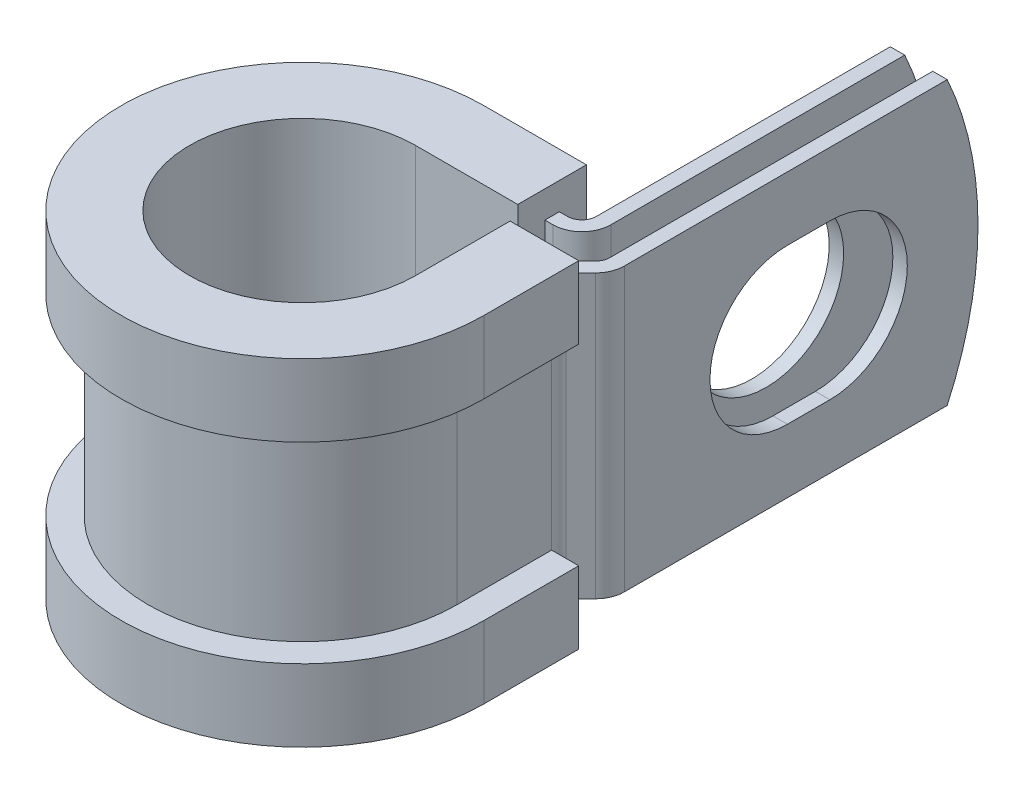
ISO-10303-21;
HEADER;
FILE_DESCRIPTION(('STEP AP214'),'2;1');
FILE_NAME('part.step','',(''),(''),'','','');
FILE_SCHEMA(('AUTOMOTIVE_DESIGN { 1 0 10303 214 1 1 1 1 }'));
ENDSEC;
DATA;
#1=APPLICATION_CONTEXT('core data for automotive mechanical design processes');
#2=APPLICATION_PROTOCOL_DEFINITION('international standard','automotive_design',2000,#1);
#3=PRODUCT_CONTEXT('',#1,'mechanical');
#4=PRODUCT('Part','Part','',(#3));
#5=PRODUCT_RELATED_PRODUCT_CATEGORY('part','',(#4));
#6=PRODUCT_DEFINITION_FORMATION('','',#4);
#7=PRODUCT_DEFINITION_CONTEXT('part definition',#1,'design');
#8=PRODUCT_DEFINITION('design','',#6,#7);
#9=PRODUCT_DEFINITION_SHAPE('','',#8);
#10=(LENGTH_UNIT() NAMED_UNIT(*) SI_UNIT(.MILLI.,.METRE.));
#11=(NAMED_UNIT(*) PLANE_ANGLE_UNIT() SI_UNIT($,.RADIAN.));
#12=(NAMED_UNIT(*) SI_UNIT($,.STERADIAN.) SOLID_ANGLE_UNIT());
#13=UNCERTAINTY_MEASURE_WITH_UNIT(LENGTH_MEASURE(1.E-05),#10,'distance_accuracy_value','');
#14=(GEOMETRIC_REPRESENTATION_CONTEXT(3) GLOBAL_UNCERTAINTY_ASSIGNED_CONTEXT((#13)) GLOBAL_UNIT_ASSIGNED_CONTEXT((#10,
#11,#12)) REPRESENTATION_CONTEXT('',''));
#15=CARTESIAN_POINT('',(0.,0.,0.));
#16=DIRECTION('',(0.,0.,1.));
#17=DIRECTION('',(1.,0.,0.));
#18=AXIS2_PLACEMENT_3D('',#15,#16,#17);
#19=CARTESIAN_POINT('',(8.60157438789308,-7.9375,-7.874));
#20=DIRECTION('',(0.,1.,0.));
#21=DIRECTION('',(1.,0.,0.));
#22=AXIS2_PLACEMENT_3D('',#19,#20,#21);
#23=PLANE('',#22);
#24=DIRECTION('',(0.,0.,-1.));
#25=VECTOR('',#24,1.);
#26=CARTESIAN_POINT('',(5.75677438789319,-7.9375,-7.874));
#27=LINE('',#26,#25);
#28=CARTESIAN_POINT('',(5.75677438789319,-7.9375,-7.874));
#29=VERTEX_POINT('',#28);
#30=CARTESIAN_POINT('',(5.7567743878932,-7.9375,-8.6868));
#31=VERTEX_POINT('',#30);
#32=EDGE_CURVE('E523',#29,#31,#27,.T.);
#33=ORIENTED_EDGE('',*,*,#32,.T.);
#34=DIRECTION('',(1.,0.,0.));
#35=VECTOR('',#34,1.);
#36=CARTESIAN_POINT('',(0.,-7.9375,-8.6868));
#37=LINE('',#36,#35);
#38=CARTESIAN_POINT('',(6.21397438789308,-7.9375,-8.6868));
#39=VERTEX_POINT('',#38);
#40=EDGE_CURVE('E410',#39,#31,#37,.F.);
#41=ORIENTED_EDGE('',*,*,#40,.F.);
#42=CARTESIAN_POINT('',(6.21397438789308,-7.9375,-9.4996));
#43=DIRECTION('',(0.,1.,0.));
#44=DIRECTION('',(1.,0.,0.));
#45=AXIS2_PLACEMENT_3D('',#42,#43,#44);
#46=CIRCLE('',#45,0.812799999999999);
#47=CARTESIAN_POINT('',(7.02677438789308,-7.9375,-9.4996));
#48=VERTEX_POINT('',#47);
#49=EDGE_CURVE('E408',#48,#39,#46,.F.);
#50=ORIENTED_EDGE('',*,*,#49,.F.);
#51=DIRECTION('',(0.,0.,1.));
#52=VECTOR('',#51,1.);
#53=CARTESIAN_POINT('',(7.02677438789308,-7.9375,-27.7622));
#54=LINE('',#53,#52);
#55=CARTESIAN_POINT('',(7.02677438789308,-7.9375,-26.0297804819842));
#56=VERTEX_POINT('',#55);
#57=EDGE_CURVE('E406',#56,#48,#54,.T.);
#58=ORIENTED_EDGE('',*,*,#57,.F.);
#59=DIRECTION('',(-1.,0.,0.));
#60=VECTOR('',#59,1.);
#61=CARTESIAN_POINT('',(10.2271743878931,-7.9375,-26.0297804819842));
#62=LINE('',#61,#60);
#63=CARTESIAN_POINT('',(7.83957438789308,-7.9375,-26.0297804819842));
#64=VERTEX_POINT('',#63);
#65=EDGE_CURVE('E12',#64,#56,#62,.T.);
#66=ORIENTED_EDGE('',*,*,#65,.F.);
#67=DIRECTION('',(0.,0.,1.));
#68=VECTOR('',#67,1.);
#69=CARTESIAN_POINT('',(7.83957438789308,-7.9375,-27.7622));
#70=LINE('',#69,#68);
#71=CARTESIAN_POINT('',(7.83957438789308,-7.9375,-9.4996));
#72=VERTEX_POINT('',#71);
#73=EDGE_CURVE('E404',#64,#72,#70,.T.);
#74=ORIENTED_EDGE('',*,*,#73,.T.);
#75=CARTESIAN_POINT('',(6.21397438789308,-7.9375,-9.4996));
#76=DIRECTION('',(0.,-1.,0.));
#77=DIRECTION('',(0.,0.,1.));
#78=AXIS2_PLACEMENT_3D('',#75,#76,#77);
#79=CIRCLE('',#78,1.6256);
#80=CARTESIAN_POINT('',(6.21397438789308,-7.9375,-7.874));
#81=VERTEX_POINT('',#80);
#82=EDGE_CURVE('E401',#72,#81,#79,.T.);
#83=ORIENTED_EDGE('',*,*,#82,.T.);
#84=DIRECTION('',(-1.,0.,0.));
#85=VECTOR('',#84,1.);
#86=CARTESIAN_POINT('',(0.,-7.9375,-7.874));
#87=LINE('',#86,#85);
#88=EDGE_CURVE('E398',#81,#29,#87,.T.);
#89=ORIENTED_EDGE('',*,*,#88,.T.);
#90=EDGE_LOOP('',(#33,#41,#50,#58,#66,#74,#83,#89));
#91=FACE_BOUND('',#90,.T.);
#92=ADVANCED_FACE('F54',(#91),#23,.F.);
#93=CARTESIAN_POINT('',(8.60157438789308,7.9375,-7.874));
#94=DIRECTION('',(0.,1.,0.));
#95=DIRECTION('',(1.,0.,0.));
#96=AXIS2_PLACEMENT_3D('',#93,#94,#95);
#97=PLANE('',#96);
#98=DIRECTION('',(1.,0.,0.));
#99=VECTOR('',#98,1.);
#100=CARTESIAN_POINT('',(0.,7.9375,-8.6868));
#101=LINE('',#100,#99);
#102=CARTESIAN_POINT('',(6.21397438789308,7.9375,-8.6868));
#103=VERTEX_POINT('',#102);
#104=CARTESIAN_POINT('',(5.7567743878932,7.9375,-8.6868));
#105=VERTEX_POINT('',#104);
#106=EDGE_CURVE('E368',#103,#105,#101,.F.);
#107=ORIENTED_EDGE('',*,*,#106,.T.);
#108=DIRECTION('',(0.,0.,1.));
#109=VECTOR('',#108,1.);
#110=CARTESIAN_POINT('',(5.7567743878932,7.9375,-8.6868));
#111=LINE('',#110,#109);
#112=CARTESIAN_POINT('',(5.75677438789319,7.9375,-7.874));
#113=VERTEX_POINT('',#112);
#114=EDGE_CURVE('E517',#105,#113,#111,.T.);
#115=ORIENTED_EDGE('',*,*,#114,.T.);
#116=DIRECTION('',(-1.,0.,0.));
#117=VECTOR('',#116,1.);
#118=CARTESIAN_POINT('',(0.,7.9375,-7.874));
#119=LINE('',#118,#117);
#120=CARTESIAN_POINT('',(6.21397438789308,7.9375,-7.874));
#121=VERTEX_POINT('',#120);
#122=EDGE_CURVE('E625',#121,#113,#119,.T.);
#123=ORIENTED_EDGE('',*,*,#122,.F.);
#124=CARTESIAN_POINT('',(6.21397438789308,7.9375,-9.4996));
#125=DIRECTION('',(0.,-1.,0.));
#126=DIRECTION('',(0.,0.,1.));
#127=AXIS2_PLACEMENT_3D('',#124,#125,#126);
#128=CIRCLE('',#127,1.6256);
#129=CARTESIAN_POINT('',(7.83957438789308,7.9375,-9.4996));
#130=VERTEX_POINT('',#129);
#131=EDGE_CURVE('E370',#130,#121,#128,.T.);
#132=ORIENTED_EDGE('',*,*,#131,.F.);
#133=DIRECTION('',(0.,0.,1.));
#134=VECTOR('',#133,1.);
#135=CARTESIAN_POINT('',(7.83957438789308,7.9375,-27.7622));
#136=LINE('',#135,#134);
#137=CARTESIAN_POINT('',(7.83957438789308,7.9375,-26.0297804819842));
#138=VERTEX_POINT('',#137);
#139=EDGE_CURVE('E361',#138,#130,#136,.T.);
#140=ORIENTED_EDGE('',*,*,#139,.F.);
#141=DIRECTION('',(-1.,0.,0.));
#142=VECTOR('',#141,1.);
#143=CARTESIAN_POINT('',(10.2271743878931,7.9375,-26.0297804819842));
#144=LINE('',#143,#142);
#145=CARTESIAN_POINT('',(7.02677438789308,7.9375,-26.0297804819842));
#146=VERTEX_POINT('',#145);
#147=EDGE_CURVE('E62',#138,#146,#144,.T.);
#148=ORIENTED_EDGE('',*,*,#147,.T.);
#149=DIRECTION('',(0.,0.,1.));
#150=VECTOR('',#149,1.);
#151=CARTESIAN_POINT('',(7.02677438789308,7.9375,-27.7622));
#152=LINE('',#151,#150);
#153=CARTESIAN_POINT('',(7.02677438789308,7.9375,-9.4996));
#154=VERTEX_POINT('',#153);
#155=EDGE_CURVE('E358',#146,#154,#152,.T.);
#156=ORIENTED_EDGE('',*,*,#155,.T.);
#157=CARTESIAN_POINT('',(6.21397438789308,7.9375,-9.4996));
#158=DIRECTION('',(0.,1.,0.));
#159=DIRECTION('',(1.,0.,0.));
#160=AXIS2_PLACEMENT_3D('',#157,#158,#159);
#161=CIRCLE('',#160,0.812799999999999);
#162=EDGE_CURVE('E366',#154,#103,#161,.F.);
#163=ORIENTED_EDGE('',*,*,#162,.T.);
#164=EDGE_LOOP('',(#107,#115,#123,#132,#140,#148,#156,#163));
#165=FACE_BOUND('',#164,.T.);
#166=ADVANCED_FACE('F357',(#165),#97,.T.);
#167=CARTESIAN_POINT('',(0.,7.9375,-7.874));
#168=DIRECTION('',(0.,0.,1.));
#169=DIRECTION('',(1.,0.,0.));
#170=AXIS2_PLACEMENT_3D('',#167,#168,#169);
#171=PLANE('',#170);
#172=ORIENTED_EDGE('',*,*,#122,.T.);
#173=DIRECTION('',(0.,-1.,0.));
#174=VECTOR('',#173,1.);
#175=CARTESIAN_POINT('',(5.75677438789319,7.9375,-7.874));
#176=LINE('',#175,#174);
#177=EDGE_CURVE('E520',#113,#29,#176,.T.);
#178=ORIENTED_EDGE('',*,*,#177,.T.);
#179=ORIENTED_EDGE('',*,*,#88,.F.);
#180=DIRECTION('',(0.,-1.,0.));
#181=VECTOR('',#180,1.);
#182=CARTESIAN_POINT('',(6.21397438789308,7.9375,-7.874));
#183=LINE('',#182,#181);
#184=EDGE_CURVE('E344',#121,#81,#183,.T.);
#185=ORIENTED_EDGE('',*,*,#184,.F.);
#186=EDGE_LOOP('',(#172,#178,#179,#185));
#187=FACE_BOUND('',#186,.T.);
#188=ADVANCED_FACE('F635',(#187),#171,.T.);
#189=CARTESIAN_POINT('',(10.2271743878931,7.9375,-7.874));
#190=DIRECTION('',(-1.,0.,0.));
#191=DIRECTION('',(0.,0.,1.));
#192=AXIS2_PLACEMENT_3D('',#189,#190,#191);
#193=PLANE('',#192);
#194=CARTESIAN_POINT('',(10.2271743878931,0.,-19.4309999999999));
#195=DIRECTION('',(1.,0.,0.));
#196=DIRECTION('',(0.,0.,-1.));
#197=AXIS2_PLACEMENT_3D('',#194,#195,#196);
#198=CIRCLE('',#197,4.3561);
#199=CARTESIAN_POINT('',(10.2271743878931,-4.3561,-19.4310000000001));
#200=VERTEX_POINT('',#199);
#201=CARTESIAN_POINT('',(10.2271743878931,4.3561,-19.4310000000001));
#202=VERTEX_POINT('',#201);
#203=EDGE_CURVE('E580',#200,#202,#198,.T.);
#204=ORIENTED_EDGE('',*,*,#203,.F.);
#205=DIRECTION('',(0.,0.,-1.));
#206=VECTOR('',#205,1.);
#207=CARTESIAN_POINT('',(10.2271743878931,-4.3561,-17.0433999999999));
#208=LINE('',#207,#206);
#209=CARTESIAN_POINT('',(10.2271743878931,-4.3561,-17.0433999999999));
#210=VERTEX_POINT('',#209);
#211=EDGE_CURVE('E583',#210,#200,#208,.T.);
#212=ORIENTED_EDGE('',*,*,#211,.F.);
#213=CARTESIAN_POINT('',(10.2271743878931,0.,-17.0433999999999));
#214=DIRECTION('',(1.,0.,0.));
#215=DIRECTION('',(0.,0.,-1.));
#216=AXIS2_PLACEMENT_3D('',#213,#214,#215);
#217=CIRCLE('',#216,4.3561);
#218=CARTESIAN_POINT('',(10.2271743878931,4.3561,-17.0433999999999));
#219=VERTEX_POINT('',#218);
#220=EDGE_CURVE('E576',#219,#210,#217,.T.);
#221=ORIENTED_EDGE('',*,*,#220,.F.);
#222=DIRECTION('',(0.,0.,1.));
#223=VECTOR('',#222,1.);
#224=CARTESIAN_POINT('',(10.2271743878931,4.3561,-17.0433999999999));
#225=LINE('',#224,#223);
#226=EDGE_CURVE('E577',#202,#219,#225,.T.);
#227=ORIENTED_EDGE('',*,*,#226,.F.);
#228=EDGE_LOOP('',(#204,#212,#221,#227));
#229=FACE_BOUND('',#228,.T.);
#230=DIRECTION('',(0.,0.,-1.));
#231=VECTOR('',#230,1.);
#232=CARTESIAN_POINT('',(10.2271743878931,-7.9375,-7.874));
#233=LINE('',#232,#231);
#234=CARTESIAN_POINT('',(10.2271743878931,-7.9375,-7.874));
#235=VERTEX_POINT('',#234);
#236=CARTESIAN_POINT('',(10.2271743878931,-7.9375,-26.0297804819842));
#237=VERTEX_POINT('',#236);
#238=EDGE_CURVE('E382',#235,#237,#233,.T.);
#239=ORIENTED_EDGE('',*,*,#238,.T.);
#240=CARTESIAN_POINT('',(10.2271743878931,0.,-8.7122));
#241=DIRECTION('',(-1.,0.,0.));
#242=DIRECTION('',(0.,0.,1.));
#243=AXIS2_PLACEMENT_3D('',#240,#241,#242);
#244=CIRCLE('',#243,19.05);
#245=CARTESIAN_POINT('',(10.2271743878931,7.9375,-26.0297804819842));
#246=VERTEX_POINT('',#245);
#247=EDGE_CURVE('E568',#246,#237,#244,.T.);
#248=ORIENTED_EDGE('',*,*,#247,.F.);
#249=DIRECTION('',(0.,0.,-1.));
#250=VECTOR('',#249,1.);
#251=CARTESIAN_POINT('',(10.2271743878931,7.9375,-7.874));
#252=LINE('',#251,#250);
#253=CARTESIAN_POINT('',(10.2271743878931,7.9375,-7.874));
#254=VERTEX_POINT('',#253);
#255=EDGE_CURVE('E419',#254,#246,#252,.T.);
#256=ORIENTED_EDGE('',*,*,#255,.F.);
#257=DIRECTION('',(0.,-1.,0.));
#258=VECTOR('',#257,1.);
#259=CARTESIAN_POINT('',(10.2271743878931,7.9375,-7.874));
#260=LINE('',#259,#258);
#261=EDGE_CURVE('E381',#254,#235,#260,.T.);
#262=ORIENTED_EDGE('',*,*,#261,.T.);
#263=EDGE_LOOP('',(#239,#248,#256,#262));
#264=FACE_BOUND('',#263,.T.);
#265=ADVANCED_FACE('F56',(#229,#264),#193,.F.);
#266=CARTESIAN_POINT('',(9.41437438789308,7.9375,-7.874));
#267=DIRECTION('',(-1.,0.,0.));
#268=DIRECTION('',(0.,0.,1.));
#269=AXIS2_PLACEMENT_3D('',#266,#267,#268);
#270=PLANE('',#269);
#271=DIRECTION('',(0.,0.,-1.));
#272=VECTOR('',#271,1.);
#273=CARTESIAN_POINT('',(9.41437438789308,-4.3561,-17.0433999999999));
#274=LINE('',#273,#272);
#275=CARTESIAN_POINT('',(9.41437438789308,-4.3561,-17.0433999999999));
#276=VERTEX_POINT('',#275);
#277=CARTESIAN_POINT('',(9.41437438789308,-4.3561,-19.4310000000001));
#278=VERTEX_POINT('',#277);
#279=EDGE_CURVE('E579',#276,#278,#274,.T.);
#280=ORIENTED_EDGE('',*,*,#279,.T.);
#281=CARTESIAN_POINT('',(9.41437438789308,0.,-19.4309999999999));
#282=DIRECTION('',(-1.,0.,0.));
#283=DIRECTION('',(0.,0.,1.));
#284=AXIS2_PLACEMENT_3D('',#281,#282,#283);
#285=CIRCLE('',#284,4.3561);
#286=CARTESIAN_POINT('',(9.41437438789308,4.3561,-19.4310000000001));
#287=VERTEX_POINT('',#286);
#288=EDGE_CURVE('E600',#278,#287,#285,.F.);
#289=ORIENTED_EDGE('',*,*,#288,.T.);
#290=DIRECTION('',(0.,0.,1.));
#291=VECTOR('',#290,1.);
#292=CARTESIAN_POINT('',(9.41437438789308,4.3561,-17.0433999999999));
#293=LINE('',#292,#291);
#294=CARTESIAN_POINT('',(9.41437438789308,4.3561,-17.0433999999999));
#295=VERTEX_POINT('',#294);
#296=EDGE_CURVE('E596',#287,#295,#293,.T.);
#297=ORIENTED_EDGE('',*,*,#296,.T.);
#298=CARTESIAN_POINT('',(9.41437438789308,0.,-17.0433999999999));
#299=DIRECTION('',(-1.,0.,0.));
#300=DIRECTION('',(0.,0.,1.));
#301=AXIS2_PLACEMENT_3D('',#298,#299,#300);
#302=CIRCLE('',#301,4.3561);
#303=EDGE_CURVE('E591',#295,#276,#302,.F.);
#304=ORIENTED_EDGE('',*,*,#303,.T.);
#305=EDGE_LOOP('',(#280,#289,#297,#304));
#306=FACE_BOUND('',#305,.T.);
#307=CARTESIAN_POINT('',(9.41437438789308,0.,-8.7122));
#308=DIRECTION('',(-1.,0.,0.));
#309=DIRECTION('',(0.,0.,1.));
#310=AXIS2_PLACEMENT_3D('',#307,#308,#309);
#311=CIRCLE('',#310,19.05);
#312=CARTESIAN_POINT('',(9.41437438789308,7.9375,-26.0297804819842));
#313=VERTEX_POINT('',#312);
#314=CARTESIAN_POINT('',(9.41437438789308,-7.9375,-26.0297804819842));
#315=VERTEX_POINT('',#314);
#316=EDGE_CURVE('E76',#313,#315,#311,.T.);
#317=ORIENTED_EDGE('',*,*,#316,.T.);
#318=DIRECTION('',(0.,0.,-1.));
#319=VECTOR('',#318,1.);
#320=CARTESIAN_POINT('',(9.41437438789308,-7.9375,-7.874));
#321=LINE('',#320,#319);
#322=CARTESIAN_POINT('',(9.41437438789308,-7.9375,-7.874));
#323=VERTEX_POINT('',#322);
#324=EDGE_CURVE('E385',#323,#315,#321,.T.);
#325=ORIENTED_EDGE('',*,*,#324,.F.);
#326=DIRECTION('',(0.,-1.,0.));
#327=VECTOR('',#326,1.);
#328=CARTESIAN_POINT('',(9.41437438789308,7.9375,-7.874));
#329=LINE('',#328,#327);
#330=CARTESIAN_POINT('',(9.41437438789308,7.9375,-7.874));
#331=VERTEX_POINT('',#330);
#332=EDGE_CURVE('E352',#331,#323,#329,.T.);
#333=ORIENTED_EDGE('',*,*,#332,.F.);
#334=DIRECTION('',(0.,0.,-1.));
#335=VECTOR('',#334,1.);
#336=CARTESIAN_POINT('',(9.41437438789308,7.9375,-7.874));
#337=LINE('',#336,#335);
#338=EDGE_CURVE('E615',#331,#313,#337,.T.);
#339=ORIENTED_EDGE('',*,*,#338,.T.);
#340=EDGE_LOOP('',(#317,#325,#333,#339));
#341=FACE_BOUND('',#340,.T.);
#342=ADVANCED_FACE('F689',(#306,#341),#270,.T.);
#343=CARTESIAN_POINT('',(7.83957438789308,7.9375,-27.7622));
#344=DIRECTION('',(1.,0.,0.));
#345=DIRECTION('',(0.,0.,-1.));
#346=AXIS2_PLACEMENT_3D('',#343,#344,#345);
#347=PLANE('',#346);
#348=CARTESIAN_POINT('',(7.83957438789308,0.,-18.2372));
#349=DIRECTION('',(1.,0.,0.));
#350=DIRECTION('',(0.,0.,-1.));
#351=AXIS2_PLACEMENT_3D('',#348,#349,#350);
#352=CIRCLE('',#351,4.3561);
#353=CARTESIAN_POINT('',(7.83957438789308,0.,-22.5933));
#354=VERTEX_POINT('',#353);
#355=EDGE_CURVE('E386',#354,#354,#352,.F.);
#356=ORIENTED_EDGE('',*,*,#355,.T.);
#357=EDGE_LOOP('',(#356));
#358=FACE_BOUND('',#357,.T.);
#359=ORIENTED_EDGE('',*,*,#73,.F.);
#360=CARTESIAN_POINT('',(7.83957438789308,0.,-8.7122));
#361=DIRECTION('',(1.,0.,0.));
#362=DIRECTION('',(0.,0.,-1.));
#363=AXIS2_PLACEMENT_3D('',#360,#361,#362);
#364=CIRCLE('',#363,19.05);
#365=EDGE_CURVE('E573',#64,#138,#364,.T.);
#366=ORIENTED_EDGE('',*,*,#365,.T.);
#367=ORIENTED_EDGE('',*,*,#139,.T.);
#368=DIRECTION('',(0.,-1.,0.));
#369=VECTOR('',#368,1.);
#370=CARTESIAN_POINT('',(7.83957438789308,7.9375,-9.4996));
#371=LINE('',#370,#369);
#372=EDGE_CURVE('E341',#130,#72,#371,.T.);
#373=ORIENTED_EDGE('',*,*,#372,.T.);
#374=EDGE_LOOP('',(#359,#366,#367,#373));
#375=FACE_BOUND('',#374,.T.);
#376=ADVANCED_FACE('F641',(#358,#375),#347,.T.);
#377=CARTESIAN_POINT('',(7.02677438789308,7.9375,-27.7622));
#378=DIRECTION('',(1.,0.,0.));
#379=DIRECTION('',(0.,0.,-1.));
#380=AXIS2_PLACEMENT_3D('',#377,#378,#379);
#381=PLANE('',#380);
#382=CARTESIAN_POINT('',(7.02677438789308,0.,-18.2372));
#383=DIRECTION('',(-1.,0.,0.));
#384=DIRECTION('',(0.,0.,1.));
#385=AXIS2_PLACEMENT_3D('',#382,#383,#384);
#386=CIRCLE('',#385,4.3561);
#387=CARTESIAN_POINT('',(7.02677438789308,0.,-13.8811));
#388=VERTEX_POINT('',#387);
#389=EDGE_CURVE('E608',#388,#388,#386,.T.);
#390=ORIENTED_EDGE('',*,*,#389,.F.);
#391=EDGE_LOOP('',(#390));
#392=FACE_BOUND('',#391,.T.);
#393=CARTESIAN_POINT('',(7.02677438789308,0.,-8.7122));
#394=DIRECTION('',(-1.,0.,0.));
#395=DIRECTION('',(0.,0.,1.));
#396=AXIS2_PLACEMENT_3D('',#393,#394,#395);
#397=CIRCLE('',#396,19.05);
#398=EDGE_CURVE('E68',#146,#56,#397,.T.);
#399=ORIENTED_EDGE('',*,*,#398,.T.);
#400=ORIENTED_EDGE('',*,*,#57,.T.);
#401=DIRECTION('',(0.,-1.,0.));
#402=VECTOR('',#401,1.);
#403=CARTESIAN_POINT('',(7.02677438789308,7.9375,-9.4996));
#404=LINE('',#403,#402);
#405=EDGE_CURVE('E338',#154,#48,#404,.T.);
#406=ORIENTED_EDGE('',*,*,#405,.F.);
#407=ORIENTED_EDGE('',*,*,#155,.F.);
#408=EDGE_LOOP('',(#399,#400,#406,#407));
#409=FACE_BOUND('',#408,.T.);
#410=ADVANCED_FACE('F364',(#392,#409),#381,.F.);
#411=CARTESIAN_POINT('',(9.4996,-7.9375,-5.32360726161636));
#412=DIRECTION('',(0.,1.,0.));
#413=DIRECTION('',(1.,0.,0.));
#414=AXIS2_PLACEMENT_3D('',#411,#412,#413);
#415=CIRCLE('',#414,0.8128);
#416=CARTESIAN_POINT('',(8.6868,-7.9375,-5.32360726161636));
#417=VERTEX_POINT('',#416);
#418=CARTESIAN_POINT('',(8.92486360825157,-7.9375,-5.89834365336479));
#419=VERTEX_POINT('',#418);
#420=EDGE_CURVE('E413',#417,#419,#415,.F.);
#421=ORIENTED_EDGE('',*,*,#420,.F.);
#422=DIRECTION('',(1.,0.,0.));
#423=VECTOR('',#422,1.);
#424=CARTESIAN_POINT('',(7.874,-7.9375,-5.32360726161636));
#425=LINE('',#424,#423);
#426=CARTESIAN_POINT('',(7.874,-7.9375,-5.32360726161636));
#427=VERTEX_POINT('',#426);
#428=EDGE_CURVE('E451',#427,#417,#425,.T.);
#429=ORIENTED_EDGE('',*,*,#428,.F.);
#430=CARTESIAN_POINT('',(9.4996,-7.9375,-5.32360726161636));
#431=DIRECTION('',(0.,-1.,0.));
#432=DIRECTION('',(0.,0.,1.));
#433=AXIS2_PLACEMENT_3D('',#430,#431,#432);
#434=CIRCLE('',#433,1.6256);
#435=CARTESIAN_POINT('',(8.35012721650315,-7.9375,-6.47308004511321));
#436=VERTEX_POINT('',#435);
#437=EDGE_CURVE('E395',#427,#436,#434,.T.);
#438=ORIENTED_EDGE('',*,*,#437,.T.);
#439=DIRECTION('',(0.707106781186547,0.,-0.707106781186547));
#440=VECTOR('',#439,1.);
#441=CARTESIAN_POINT('',(8.35012721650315,-7.9375,-6.47308004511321));
#442=LINE('',#441,#440);
#443=CARTESIAN_POINT('',(9.17631077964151,-7.9375,-7.29926360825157));
#444=VERTEX_POINT('',#443);
#445=EDGE_CURVE('E392',#436,#444,#442,.T.);
#446=ORIENTED_EDGE('',*,*,#445,.T.);
#447=CARTESIAN_POINT('',(8.60157438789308,-7.9375,-7.874));
#448=DIRECTION('',(0.,1.,0.));
#449=DIRECTION('',(0.,0.,1.));
#450=AXIS2_PLACEMENT_3D('',#447,#448,#449);
#451=CIRCLE('',#450,0.812800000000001);
#452=EDGE_CURVE('E389',#444,#323,#451,.T.);
#453=ORIENTED_EDGE('',*,*,#452,.T.);
#454=ORIENTED_EDGE('',*,*,#324,.T.);
#455=DIRECTION('',(-1.,0.,0.));
#456=VECTOR('',#455,1.);
#457=CARTESIAN_POINT('',(10.2271743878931,-7.9375,-26.0297804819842));
#458=LINE('',#457,#456);
#459=EDGE_CURVE('E566',#237,#315,#458,.T.);
#460=ORIENTED_EDGE('',*,*,#459,.F.);
#461=ORIENTED_EDGE('',*,*,#238,.F.);
#462=CARTESIAN_POINT('',(8.60157438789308,-7.9375,-7.874));
#463=DIRECTION('',(0.,1.,0.));
#464=DIRECTION('',(1.,0.,0.));
#465=AXIS2_PLACEMENT_3D('',#462,#463,#464);
#466=CIRCLE('',#465,1.6256);
#467=CARTESIAN_POINT('',(9.75104717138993,-7.9375,-6.72452721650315));
#468=VERTEX_POINT('',#467);
#469=EDGE_CURVE('E417',#468,#235,#466,.T.);
#470=ORIENTED_EDGE('',*,*,#469,.F.);
#471=DIRECTION('',(0.707106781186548,0.,-0.707106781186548));
#472=VECTOR('',#471,1.);
#473=CARTESIAN_POINT('',(8.92486360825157,-7.9375,-5.89834365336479));
#474=LINE('',#473,#472);
#475=EDGE_CURVE('E415',#419,#468,#474,.T.);
#476=ORIENTED_EDGE('',*,*,#475,.F.);
#477=EDGE_LOOP('',(#421,#429,#438,#446,#453,#454,#460,#461,#470,#476));
#478=FACE_BOUND('',#477,.T.);
#479=ADVANCED_FACE('F675',(#478),#23,.F.);
#480=DIRECTION('',(-1.,0.,0.));
#481=VECTOR('',#480,1.);
#482=CARTESIAN_POINT('',(8.6868,7.9375,-5.32360726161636));
#483=LINE('',#482,#481);
#484=CARTESIAN_POINT('',(8.6868,7.9375,-5.32360726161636));
#485=VERTEX_POINT('',#484);
#486=CARTESIAN_POINT('',(7.874,7.9375,-5.32360726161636));
#487=VERTEX_POINT('',#486);
#488=EDGE_CURVE('E440',#485,#487,#483,.T.);
#489=ORIENTED_EDGE('',*,*,#488,.F.);
#490=CARTESIAN_POINT('',(9.4996,7.9375,-5.32360726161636));
#491=DIRECTION('',(0.,1.,0.));
#492=DIRECTION('',(1.,0.,0.));
#493=AXIS2_PLACEMENT_3D('',#490,#491,#492);
#494=CIRCLE('',#493,0.8128);
#495=CARTESIAN_POINT('',(8.92486360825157,7.9375,-5.89834365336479));
#496=VERTEX_POINT('',#495);
#497=EDGE_CURVE('E375',#485,#496,#494,.F.);
#498=ORIENTED_EDGE('',*,*,#497,.T.);
#499=DIRECTION('',(0.707106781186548,0.,-0.707106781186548));
#500=VECTOR('',#499,1.);
#501=CARTESIAN_POINT('',(8.92486360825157,7.9375,-5.89834365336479));
#502=LINE('',#501,#500);
#503=CARTESIAN_POINT('',(9.75104717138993,7.9375,-6.72452721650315));
#504=VERTEX_POINT('',#503);
#505=EDGE_CURVE('E377',#496,#504,#502,.T.);
#506=ORIENTED_EDGE('',*,*,#505,.T.);
#507=CARTESIAN_POINT('',(8.60157438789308,7.9375,-7.874));
#508=DIRECTION('',(0.,1.,0.));
#509=DIRECTION('',(1.,0.,0.));
#510=AXIS2_PLACEMENT_3D('',#507,#508,#509);
#511=CIRCLE('',#510,1.6256);
#512=EDGE_CURVE('E379',#504,#254,#511,.T.);
#513=ORIENTED_EDGE('',*,*,#512,.T.);
#514=ORIENTED_EDGE('',*,*,#255,.T.);
#515=DIRECTION('',(-1.,0.,0.));
#516=VECTOR('',#515,1.);
#517=CARTESIAN_POINT('',(10.2271743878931,7.9375,-26.0297804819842));
#518=LINE('',#517,#516);
#519=EDGE_CURVE('E570',#246,#313,#518,.T.);
#520=ORIENTED_EDGE('',*,*,#519,.T.);
#521=ORIENTED_EDGE('',*,*,#338,.F.);
#522=CARTESIAN_POINT('',(8.60157438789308,7.9375,-7.874));
#523=DIRECTION('',(0.,1.,0.));
#524=DIRECTION('',(0.,0.,1.));
#525=AXIS2_PLACEMENT_3D('',#522,#523,#524);
#526=CIRCLE('',#525,0.812800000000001);
#527=CARTESIAN_POINT('',(9.17631077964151,7.9375,-7.29926360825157));
#528=VERTEX_POINT('',#527);
#529=EDGE_CURVE('E618',#528,#331,#526,.T.);
#530=ORIENTED_EDGE('',*,*,#529,.F.);
#531=DIRECTION('',(0.707106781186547,0.,-0.707106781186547));
#532=VECTOR('',#531,1.);
#533=CARTESIAN_POINT('',(8.35012721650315,7.9375,-6.47308004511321));
#534=LINE('',#533,#532);
#535=CARTESIAN_POINT('',(8.35012721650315,7.9375,-6.47308004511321));
#536=VERTEX_POINT('',#535);
#537=EDGE_CURVE('E621',#536,#528,#534,.T.);
#538=ORIENTED_EDGE('',*,*,#537,.F.);
#539=CARTESIAN_POINT('',(9.4996,7.9375,-5.32360726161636));
#540=DIRECTION('',(0.,-1.,0.));
#541=DIRECTION('',(0.,0.,1.));
#542=AXIS2_PLACEMENT_3D('',#539,#540,#541);
#543=CIRCLE('',#542,1.6256);
#544=EDGE_CURVE('E450',#487,#536,#543,.T.);
#545=ORIENTED_EDGE('',*,*,#544,.F.);
#546=EDGE_LOOP('',(#489,#498,#506,#513,#514,#520,#521,#530,#538,#545));
#547=FACE_BOUND('',#546,.T.);
#548=ADVANCED_FACE('F447',(#547),#97,.T.);
#549=CARTESIAN_POINT('',(8.60157438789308,7.9375,-7.874));
#550=DIRECTION('',(0.,-1.,0.));
#551=DIRECTION('',(0.,0.,-1.));
#552=AXIS2_PLACEMENT_3D('',#549,#550,#551);
#553=CYLINDRICAL_SURFACE('',#552,0.812800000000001);
#554=ORIENTED_EDGE('',*,*,#452,.F.);
#555=DIRECTION('',(0.,-1.,0.));
#556=VECTOR('',#555,1.);
#557=CARTESIAN_POINT('',(9.17631077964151,7.9375,-7.29926360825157));
#558=LINE('',#557,#556);
#559=EDGE_CURVE('E350',#528,#444,#558,.T.);
#560=ORIENTED_EDGE('',*,*,#559,.F.);
#561=ORIENTED_EDGE('',*,*,#529,.T.);
#562=ORIENTED_EDGE('',*,*,#332,.T.);
#563=EDGE_LOOP('',(#554,#560,#561,#562));
#564=FACE_BOUND('',#563,.T.);
#565=ADVANCED_FACE('F685',(#564),#553,.F.);
#566=CARTESIAN_POINT('',(8.35012721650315,7.9375,-6.47308004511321));
#567=DIRECTION('',(-0.707106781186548,0.,-0.707106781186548));
#568=DIRECTION('',(-0.707106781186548,0.,0.707106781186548));
#569=AXIS2_PLACEMENT_3D('',#566,#567,#568);
#570=PLANE('',#569);
#571=ORIENTED_EDGE('',*,*,#445,.F.);
#572=DIRECTION('',(0.,-1.,0.));
#573=VECTOR('',#572,1.);
#574=CARTESIAN_POINT('',(8.35012721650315,7.9375,-6.47308004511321));
#575=LINE('',#574,#573);
#576=EDGE_CURVE('E348',#536,#436,#575,.T.);
#577=ORIENTED_EDGE('',*,*,#576,.F.);
#578=ORIENTED_EDGE('',*,*,#537,.T.);
#579=ORIENTED_EDGE('',*,*,#559,.T.);
#580=EDGE_LOOP('',(#571,#577,#578,#579));
#581=FACE_BOUND('',#580,.T.);
#582=ADVANCED_FACE('F680',(#581),#570,.T.);
#583=CARTESIAN_POINT('',(9.4996,7.9375,-5.32360726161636));
#584=DIRECTION('',(0.,-1.,0.));
#585=DIRECTION('',(0.,0.,-1.));
#586=AXIS2_PLACEMENT_3D('',#583,#584,#585);
#587=CYLINDRICAL_SURFACE('',#586,1.6256);
#588=ORIENTED_EDGE('',*,*,#437,.F.);
#589=DIRECTION('',(0.,-1.,0.));
#590=VECTOR('',#589,1.);
#591=CARTESIAN_POINT('',(7.874,7.9375,-5.32360726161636));
#592=LINE('',#591,#590);
#593=EDGE_CURVE('E346',#487,#427,#592,.T.);
#594=ORIENTED_EDGE('',*,*,#593,.F.);
#595=ORIENTED_EDGE('',*,*,#544,.T.);
#596=ORIENTED_EDGE('',*,*,#576,.T.);
#597=EDGE_LOOP('',(#588,#594,#595,#596));
#598=FACE_BOUND('',#597,.T.);
#599=ADVANCED_FACE('F677',(#598),#587,.T.);
#600=CARTESIAN_POINT('',(6.21397438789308,7.9375,-9.4996));
#601=DIRECTION('',(0.,-1.,0.));
#602=DIRECTION('',(0.,0.,-1.));
#603=AXIS2_PLACEMENT_3D('',#600,#601,#602);
#604=CYLINDRICAL_SURFACE('',#603,1.6256);
#605=ORIENTED_EDGE('',*,*,#82,.F.);
#606=ORIENTED_EDGE('',*,*,#372,.F.);
#607=ORIENTED_EDGE('',*,*,#131,.T.);
#608=ORIENTED_EDGE('',*,*,#184,.T.);
#609=EDGE_LOOP('',(#605,#606,#607,#608));
#610=FACE_BOUND('',#609,.T.);
#611=ADVANCED_FACE('F631',(#610),#604,.T.);
#612=CARTESIAN_POINT('',(6.21397438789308,7.9375,-9.4996));
#613=DIRECTION('',(0.,-1.,0.));
#614=DIRECTION('',(0.,0.,-1.));
#615=AXIS2_PLACEMENT_3D('',#612,#613,#614);
#616=CYLINDRICAL_SURFACE('',#615,0.812799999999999);
#617=ORIENTED_EDGE('',*,*,#49,.T.);
#618=DIRECTION('',(0.,-1.,0.));
#619=VECTOR('',#618,1.);
#620=CARTESIAN_POINT('',(6.21397438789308,7.9375,-8.6868));
#621=LINE('',#620,#619);
#622=EDGE_CURVE('E329',#103,#39,#621,.T.);
#623=ORIENTED_EDGE('',*,*,#622,.F.);
#624=ORIENTED_EDGE('',*,*,#162,.F.);
#625=ORIENTED_EDGE('',*,*,#405,.T.);
#626=EDGE_LOOP('',(#617,#623,#624,#625));
#627=FACE_BOUND('',#626,.T.);
#628=ADVANCED_FACE('F646',(#627),#616,.F.);
#629=CARTESIAN_POINT('',(0.,7.9375,-8.6868));
#630=DIRECTION('',(0.,0.,1.));
#631=DIRECTION('',(1.,0.,0.));
#632=AXIS2_PLACEMENT_3D('',#629,#630,#631);
#633=PLANE('',#632);
#634=DIRECTION('',(0.,-1.,0.));
#635=VECTOR('',#634,1.);
#636=CARTESIAN_POINT('',(0.,7.9375,-8.6868));
#637=LINE('',#636,#635);
#638=CARTESIAN_POINT('',(1.21851113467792E-13,5.3975,-8.6868));
#639=VERTEX_POINT('',#638);
#640=CARTESIAN_POINT('',(1.21851113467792E-13,-5.3975,-8.6868));
#641=VERTEX_POINT('',#640);
#642=EDGE_CURVE('E320',#639,#641,#637,.T.);
#643=ORIENTED_EDGE('',*,*,#642,.F.);
#644=DIRECTION('',(1.,0.,0.));
#645=VECTOR('',#644,1.);
#646=CARTESIAN_POINT('',(1.21851113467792E-13,5.3975,-8.6868));
#647=LINE('',#646,#645);
#648=CARTESIAN_POINT('',(5.7567743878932,5.3975,-8.6868));
#649=VERTEX_POINT('',#648);
#650=EDGE_CURVE('E563',#639,#649,#647,.T.);
#651=ORIENTED_EDGE('',*,*,#650,.T.);
#652=DIRECTION('',(0.,1.,0.));
#653=VECTOR('',#652,1.);
#654=CARTESIAN_POINT('',(5.7567743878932,7.9375,-8.6868));
#655=LINE('',#654,#653);
#656=EDGE_CURVE('E514',#649,#105,#655,.T.);
#657=ORIENTED_EDGE('',*,*,#656,.T.);
#658=ORIENTED_EDGE('',*,*,#106,.F.);
#659=ORIENTED_EDGE('',*,*,#622,.T.);
#660=ORIENTED_EDGE('',*,*,#40,.T.);
#661=DIRECTION('',(0.,1.,0.));
#662=VECTOR('',#661,1.);
#663=CARTESIAN_POINT('',(5.7567743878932,-7.9375,-8.6868));
#664=LINE('',#663,#662);
#665=CARTESIAN_POINT('',(5.7567743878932,-5.3975,-8.6868));
#666=VERTEX_POINT('',#665);
#667=EDGE_CURVE('E526',#31,#666,#664,.T.);
#668=ORIENTED_EDGE('',*,*,#667,.T.);
#669=DIRECTION('',(1.,0.,0.));
#670=VECTOR('',#669,1.);
#671=CARTESIAN_POINT('',(1.21851113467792E-13,-5.3975,-8.6868));
#672=LINE('',#671,#670);
#673=EDGE_CURVE('E543',#641,#666,#672,.T.);
#674=ORIENTED_EDGE('',*,*,#673,.F.);
#675=EDGE_LOOP('',(#643,#651,#657,#658,#659,#660,#668,#674));
#676=FACE_BOUND('',#675,.T.);
#677=ADVANCED_FACE('F650',(#676),#633,.F.);
#678=CARTESIAN_POINT('',(0.,7.9375,0.));
#679=DIRECTION('',(0.,-1.,0.));
#680=DIRECTION('',(0.,0.,-1.));
#681=AXIS2_PLACEMENT_3D('',#678,#679,#680);
#682=CYLINDRICAL_SURFACE('',#681,8.6868);
#683=DIRECTION('',(0.,-1.,0.));
#684=VECTOR('',#683,1.);
#685=CARTESIAN_POINT('',(8.6868,7.9375,0.));
#686=LINE('',#685,#684);
#687=CARTESIAN_POINT('',(8.6868,5.3975,0.));
#688=VERTEX_POINT('',#687);
#689=CARTESIAN_POINT('',(8.6868,-5.3975,0.));
#690=VERTEX_POINT('',#689);
#691=EDGE_CURVE('E318',#688,#690,#686,.T.);
#692=ORIENTED_EDGE('',*,*,#691,.F.);
#693=CARTESIAN_POINT('',(0.,5.3975,0.));
#694=DIRECTION('',(0.,-1.,0.));
#695=DIRECTION('',(0.,0.,-1.));
#696=AXIS2_PLACEMENT_3D('',#693,#694,#695);
#697=CIRCLE('',#696,8.6868);
#698=EDGE_CURVE('E512',#688,#639,#697,.T.);
#699=ORIENTED_EDGE('',*,*,#698,.T.);
#700=ORIENTED_EDGE('',*,*,#642,.T.);
#701=CARTESIAN_POINT('',(0.,-5.3975,0.));
#702=DIRECTION('',(0.,-1.,0.));
#703=DIRECTION('',(0.,0.,-1.));
#704=AXIS2_PLACEMENT_3D('',#701,#702,#703);
#705=CIRCLE('',#704,8.6868);
#706=EDGE_CURVE('E301',#690,#641,#705,.T.);
#707=ORIENTED_EDGE('',*,*,#706,.F.);
#708=EDGE_LOOP('',(#692,#699,#700,#707));
#709=FACE_BOUND('',#708,.T.);
#710=ADVANCED_FACE('F316',(#709),#682,.T.);
#711=CARTESIAN_POINT('',(8.6868,7.9375,0.));
#712=DIRECTION('',(-1.,0.,0.));
#713=DIRECTION('',(0.,0.,1.));
#714=AXIS2_PLACEMENT_3D('',#711,#712,#713);
#715=PLANE('',#714);
#716=DIRECTION('',(0.,-1.,0.));
#717=VECTOR('',#716,1.);
#718=CARTESIAN_POINT('',(8.6868,7.9375,-5.32360726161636));
#719=LINE('',#718,#717);
#720=CARTESIAN_POINT('',(8.6868,5.3975,-5.32360726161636));
#721=VERTEX_POINT('',#720);
#722=CARTESIAN_POINT('',(8.6868,-5.3975,-5.32360726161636));
#723=VERTEX_POINT('',#722);
#724=EDGE_CURVE('E332',#721,#723,#719,.T.);
#725=ORIENTED_EDGE('',*,*,#724,.F.);
#726=DIRECTION('',(0.,0.,-1.));
#727=VECTOR('',#726,1.);
#728=CARTESIAN_POINT('',(8.6868,5.3975,0.));
#729=LINE('',#728,#727);
#730=EDGE_CURVE('E326',#688,#721,#729,.T.);
#731=ORIENTED_EDGE('',*,*,#730,.F.);
#732=ORIENTED_EDGE('',*,*,#691,.T.);
#733=DIRECTION('',(0.,0.,-1.));
#734=VECTOR('',#733,1.);
#735=CARTESIAN_POINT('',(8.6868,-5.3975,0.));
#736=LINE('',#735,#734);
#737=EDGE_CURVE('E297',#690,#723,#736,.T.);
#738=ORIENTED_EDGE('',*,*,#737,.T.);
#739=EDGE_LOOP('',(#725,#731,#732,#738));
#740=FACE_BOUND('',#739,.T.);
#741=ADVANCED_FACE('F325',(#740),#715,.F.);
#742=CARTESIAN_POINT('',(9.4996,7.9375,-5.32360726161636));
#743=DIRECTION('',(0.,-1.,0.));
#744=DIRECTION('',(0.,0.,-1.));
#745=AXIS2_PLACEMENT_3D('',#742,#743,#744);
#746=CYLINDRICAL_SURFACE('',#745,0.8128);
#747=ORIENTED_EDGE('',*,*,#420,.T.);
#748=DIRECTION('',(0.,-1.,0.));
#749=VECTOR('',#748,1.);
#750=CARTESIAN_POINT('',(8.92486360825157,7.9375,-5.89834365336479));
#751=LINE('',#750,#749);
#752=EDGE_CURVE('E424',#496,#419,#751,.T.);
#753=ORIENTED_EDGE('',*,*,#752,.F.);
#754=ORIENTED_EDGE('',*,*,#497,.F.);
#755=EDGE_CURVE('E327',#485,#721,#719,.T.);
#756=ORIENTED_EDGE('',*,*,#755,.T.);
#757=ORIENTED_EDGE('',*,*,#724,.T.);
#758=DIRECTION('',(0.,1.,0.));
#759=VECTOR('',#758,1.);
#760=CARTESIAN_POINT('',(8.6868,-7.9375,-5.32360726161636));
#761=LINE('',#760,#759);
#762=EDGE_CURVE('E433',#417,#723,#761,.T.);
#763=ORIENTED_EDGE('',*,*,#762,.F.);
#764=EDGE_LOOP('',(#747,#753,#754,#756,#757,#763));
#765=FACE_BOUND('',#764,.T.);
#766=ADVANCED_FACE('F432',(#765),#746,.F.);
#767=CARTESIAN_POINT('',(8.92486360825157,7.9375,-5.89834365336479));
#768=DIRECTION('',(-0.707106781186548,0.,-0.707106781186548));
#769=DIRECTION('',(-0.707106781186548,0.,0.707106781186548));
#770=AXIS2_PLACEMENT_3D('',#767,#768,#769);
#771=PLANE('',#770);
#772=ORIENTED_EDGE('',*,*,#475,.T.);
#773=DIRECTION('',(0.,-1.,0.));
#774=VECTOR('',#773,1.);
#775=CARTESIAN_POINT('',(9.75104717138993,7.9375,-6.72452721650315));
#776=LINE('',#775,#774);
#777=EDGE_CURVE('E422',#504,#468,#776,.T.);
#778=ORIENTED_EDGE('',*,*,#777,.F.);
#779=ORIENTED_EDGE('',*,*,#505,.F.);
#780=ORIENTED_EDGE('',*,*,#752,.T.);
#781=EDGE_LOOP('',(#772,#778,#779,#780));
#782=FACE_BOUND('',#781,.T.);
#783=ADVANCED_FACE('F701',(#782),#771,.F.);
#784=CARTESIAN_POINT('',(8.60157438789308,7.9375,-7.874));
#785=DIRECTION('',(0.,-1.,0.));
#786=DIRECTION('',(0.,0.,-1.));
#787=AXIS2_PLACEMENT_3D('',#784,#785,#786);
#788=CYLINDRICAL_SURFACE('',#787,1.6256);
#789=ORIENTED_EDGE('',*,*,#469,.T.);
#790=ORIENTED_EDGE('',*,*,#261,.F.);
#791=ORIENTED_EDGE('',*,*,#512,.F.);
#792=ORIENTED_EDGE('',*,*,#777,.T.);
#793=EDGE_LOOP('',(#789,#790,#791,#792));
#794=FACE_BOUND('',#793,.T.);
#795=ADVANCED_FACE('F699',(#794),#788,.T.);
#796=CARTESIAN_POINT('',(20.160485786,0.,-18.2372));
#797=DIRECTION('',(-1.,0.,0.));
#798=DIRECTION('',(0.,0.,1.));
#799=AXIS2_PLACEMENT_3D('',#796,#797,#798);
#800=CYLINDRICAL_SURFACE('',#799,4.3561);
#801=ORIENTED_EDGE('',*,*,#389,.T.);
#802=EDGE_LOOP('',(#801));
#803=FACE_BOUND('',#802,.T.);
#804=ORIENTED_EDGE('',*,*,#355,.F.);
#805=EDGE_LOOP('',(#804));
#806=FACE_BOUND('',#805,.T.);
#807=ADVANCED_FACE('F708',(#803,#806),#800,.F.);
#808=CARTESIAN_POINT('',(-4.69618863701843,-4.3561,-17.0433999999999));
#809=DIRECTION('',(0.,-1.,0.));
#810=DIRECTION('',(0.,0.,-1.));
#811=AXIS2_PLACEMENT_3D('',#808,#809,#810);
#812=PLANE('',#811);
#813=DIRECTION('',(1.,0.,0.));
#814=VECTOR('',#813,1.);
#815=CARTESIAN_POINT('',(-4.69618863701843,-4.3561,-17.0433999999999));
#816=LINE('',#815,#814);
#817=EDGE_CURVE('E594',#276,#210,#816,.T.);
#818=ORIENTED_EDGE('',*,*,#817,.T.);
#819=ORIENTED_EDGE('',*,*,#211,.T.);
#820=DIRECTION('',(1.,0.,0.));
#821=VECTOR('',#820,1.);
#822=CARTESIAN_POINT('',(-4.69618863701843,-4.3561,-19.4310000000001));
#823=LINE('',#822,#821);
#824=EDGE_CURVE('E590',#278,#200,#823,.T.);
#825=ORIENTED_EDGE('',*,*,#824,.F.);
#826=ORIENTED_EDGE('',*,*,#279,.F.);
#827=EDGE_LOOP('',(#818,#819,#825,#826));
#828=FACE_BOUND('',#827,.T.);
#829=ADVANCED_FACE('F751',(#828),#812,.F.);
#830=CARTESIAN_POINT('',(-4.69618863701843,0.,-19.4309999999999));
#831=DIRECTION('',(1.,0.,0.));
#832=DIRECTION('',(0.,0.,-1.));
#833=AXIS2_PLACEMENT_3D('',#830,#831,#832);
#834=CYLINDRICAL_SURFACE('',#833,4.3561);
#835=ORIENTED_EDGE('',*,*,#824,.T.);
#836=ORIENTED_EDGE('',*,*,#203,.T.);
#837=DIRECTION('',(1.,0.,0.));
#838=VECTOR('',#837,1.);
#839=CARTESIAN_POINT('',(-4.69618863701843,4.3561,-19.4310000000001));
#840=LINE('',#839,#838);
#841=EDGE_CURVE('E599',#287,#202,#840,.T.);
#842=ORIENTED_EDGE('',*,*,#841,.F.);
#843=ORIENTED_EDGE('',*,*,#288,.F.);
#844=EDGE_LOOP('',(#835,#836,#842,#843));
#845=FACE_BOUND('',#844,.T.);
#846=ADVANCED_FACE('F755',(#845),#834,.F.);
#847=CARTESIAN_POINT('',(-4.69618863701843,4.3561,-17.0433999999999));
#848=DIRECTION('',(0.,1.,0.));
#849=DIRECTION('',(0.,0.,1.));
#850=AXIS2_PLACEMENT_3D('',#847,#848,#849);
#851=PLANE('',#850);
#852=ORIENTED_EDGE('',*,*,#841,.T.);
#853=ORIENTED_EDGE('',*,*,#226,.T.);
#854=DIRECTION('',(1.,0.,0.));
#855=VECTOR('',#854,1.);
#856=CARTESIAN_POINT('',(-4.69618863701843,4.3561,-17.0433999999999));
#857=LINE('',#856,#855);
#858=EDGE_CURVE('E595',#295,#219,#857,.T.);
#859=ORIENTED_EDGE('',*,*,#858,.F.);
#860=ORIENTED_EDGE('',*,*,#296,.F.);
#861=EDGE_LOOP('',(#852,#853,#859,#860));
#862=FACE_BOUND('',#861,.T.);
#863=ADVANCED_FACE('F759',(#862),#851,.F.);
#864=CARTESIAN_POINT('',(-4.69618863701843,0.,-17.0433999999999));
#865=DIRECTION('',(1.,0.,0.));
#866=DIRECTION('',(0.,0.,-1.));
#867=AXIS2_PLACEMENT_3D('',#864,#865,#866);
#868=CYLINDRICAL_SURFACE('',#867,4.3561);
#869=ORIENTED_EDGE('',*,*,#858,.T.);
#870=ORIENTED_EDGE('',*,*,#220,.T.);
#871=ORIENTED_EDGE('',*,*,#817,.F.);
#872=ORIENTED_EDGE('',*,*,#303,.F.);
#873=EDGE_LOOP('',(#869,#870,#871,#872));
#874=FACE_BOUND('',#873,.T.);
#875=ADVANCED_FACE('F763',(#874),#868,.F.);
#876=CARTESIAN_POINT('',(10.2271743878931,0.,-8.7122));
#877=DIRECTION('',(-1.,0.,0.));
#878=DIRECTION('',(0.,0.,1.));
#879=AXIS2_PLACEMENT_3D('',#876,#877,#878);
#880=CYLINDRICAL_SURFACE('',#879,19.05);
#881=ORIENTED_EDGE('',*,*,#365,.F.);
#882=ORIENTED_EDGE('',*,*,#65,.T.);
#883=ORIENTED_EDGE('',*,*,#398,.F.);
#884=ORIENTED_EDGE('',*,*,#147,.F.);
#885=EDGE_LOOP('',(#881,#882,#883,#884));
#886=FACE_BOUND('',#885,.T.);
#887=ADVANCED_FACE('F642',(#886),#880,.T.);
#888=ORIENTED_EDGE('',*,*,#519,.F.);
#889=ORIENTED_EDGE('',*,*,#247,.T.);
#890=ORIENTED_EDGE('',*,*,#459,.T.);
#891=ORIENTED_EDGE('',*,*,#316,.F.);
#892=EDGE_LOOP('',(#888,#889,#890,#891));
#893=FACE_BOUND('',#892,.T.);
#894=ADVANCED_FACE('F690',(#893),#880,.T.);
#895=CARTESIAN_POINT('',(1.43228501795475E-13,9.4615,-10.2108));
#896=DIRECTION('',(0.,0.,1.));
#897=DIRECTION('',(1.,0.,0.));
#898=AXIS2_PLACEMENT_3D('',#895,#896,#897);
#899=PLANE('',#898);
#900=DIRECTION('',(0.,-1.,0.));
#901=VECTOR('',#900,1.);
#902=CARTESIAN_POINT('',(1.43228501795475E-13,9.4615,-10.2108));
#903=LINE('',#902,#901);
#904=CARTESIAN_POINT('',(1.43228501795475E-13,9.4615,-10.2108));
#905=VERTEX_POINT('',#904);
#906=CARTESIAN_POINT('',(1.43228501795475E-13,5.3975,-10.2108));
#907=VERTEX_POINT('',#906);
#908=EDGE_CURVE('E322',#905,#907,#903,.T.);
#909=ORIENTED_EDGE('',*,*,#908,.F.);
#910=DIRECTION('',(1.,0.,0.));
#911=VECTOR('',#910,1.);
#912=CARTESIAN_POINT('',(1.43228501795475E-13,9.4615,-10.2108));
#913=LINE('',#912,#911);
#914=CARTESIAN_POINT('',(5.75677438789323,9.4615,-10.2108));
#915=VERTEX_POINT('',#914);
#916=EDGE_CURVE('E557',#905,#915,#913,.T.);
#917=ORIENTED_EDGE('',*,*,#916,.T.);
#918=DIRECTION('',(0.,-1.,0.));
#919=VECTOR('',#918,1.);
#920=CARTESIAN_POINT('',(5.75677438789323,9.4615,-10.2108));
#921=LINE('',#920,#919);
#922=CARTESIAN_POINT('',(5.75677438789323,5.3975,-10.2108));
#923=VERTEX_POINT('',#922);
#924=EDGE_CURVE('E539',#915,#923,#921,.T.);
#925=ORIENTED_EDGE('',*,*,#924,.T.);
#926=DIRECTION('',(1.,0.,0.));
#927=VECTOR('',#926,1.);
#928=CARTESIAN_POINT('',(1.43228501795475E-13,5.3975,-10.2108));
#929=LINE('',#928,#927);
#930=EDGE_CURVE('E560',#907,#923,#929,.T.);
#931=ORIENTED_EDGE('',*,*,#930,.F.);
#932=EDGE_LOOP('',(#909,#917,#925,#931));
#933=FACE_BOUND('',#932,.T.);
#934=ADVANCED_FACE('F854',(#933),#899,.F.);
#935=CARTESIAN_POINT('',(0.,9.4615,-6.35));
#936=DIRECTION('',(0.,0.,-1.));
#937=DIRECTION('',(0.,1.,0.));
#938=AXIS2_PLACEMENT_3D('',#935,#936,#937);
#939=PLANE('',#938);
#940=DIRECTION('',(0.,1.,0.));
#941=VECTOR('',#940,1.);
#942=CARTESIAN_POINT('',(0.,9.4615,-6.35));
#943=LINE('',#942,#941);
#944=CARTESIAN_POINT('',(0.,-9.4615,-6.34999999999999));
#945=VERTEX_POINT('',#944);
#946=CARTESIAN_POINT('',(0.,9.4615,-6.35));
#947=VERTEX_POINT('',#946);
#948=EDGE_CURVE('E490',#945,#947,#943,.T.);
#949=ORIENTED_EDGE('',*,*,#948,.F.);
#950=DIRECTION('',(1.,0.,0.));
#951=VECTOR('',#950,1.);
#952=CARTESIAN_POINT('',(0.,-9.4615,-6.34999999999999));
#953=LINE('',#952,#951);
#954=CARTESIAN_POINT('',(5.75677438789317,-9.4615,-6.34999999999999));
#955=VERTEX_POINT('',#954);
#956=EDGE_CURVE('E551',#945,#955,#953,.T.);
#957=ORIENTED_EDGE('',*,*,#956,.T.);
#958=DIRECTION('',(0.,1.,0.));
#959=VECTOR('',#958,1.);
#960=CARTESIAN_POINT('',(5.75677438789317,9.4615,-6.35));
#961=LINE('',#960,#959);
#962=CARTESIAN_POINT('',(5.75677438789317,9.4615,-6.35));
#963=VERTEX_POINT('',#962);
#964=EDGE_CURVE('E535',#955,#963,#961,.T.);
#965=ORIENTED_EDGE('',*,*,#964,.T.);
#966=DIRECTION('',(1.,0.,0.));
#967=VECTOR('',#966,1.);
#968=CARTESIAN_POINT('',(0.,9.4615,-6.35));
#969=LINE('',#968,#967);
#970=EDGE_CURVE('E554',#947,#963,#969,.T.);
#971=ORIENTED_EDGE('',*,*,#970,.F.);
#972=EDGE_LOOP('',(#949,#957,#965,#971));
#973=FACE_BOUND('',#972,.T.);
#974=ADVANCED_FACE('F940',(#973),#939,.F.);
#975=CARTESIAN_POINT('',(1.43228501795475E-13,-9.4615,-10.2108));
#976=DIRECTION('',(0.,0.,1.));
#977=DIRECTION('',(1.,0.,0.));
#978=AXIS2_PLACEMENT_3D('',#975,#976,#977);
#979=PLANE('',#978);
#980=DIRECTION('',(0.,-1.,0.));
#981=VECTOR('',#980,1.);
#982=CARTESIAN_POINT('',(1.43228501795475E-13,-9.4615,-10.2108));
#983=LINE('',#982,#981);
#984=CARTESIAN_POINT('',(1.43228501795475E-13,-5.3975,-10.2108));
#985=VERTEX_POINT('',#984);
#986=CARTESIAN_POINT('',(1.43228501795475E-13,-9.4615,-10.2108));
#987=VERTEX_POINT('',#986);
#988=EDGE_CURVE('E476',#985,#987,#983,.T.);
#989=ORIENTED_EDGE('',*,*,#988,.F.);
#990=DIRECTION('',(1.,0.,0.));
#991=VECTOR('',#990,1.);
#992=CARTESIAN_POINT('',(1.43228501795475E-13,-5.3975,-10.2108));
#993=LINE('',#992,#991);
#994=CARTESIAN_POINT('',(5.75677438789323,-5.3975,-10.2108));
#995=VERTEX_POINT('',#994);
#996=EDGE_CURVE('E545',#985,#995,#993,.T.);
#997=ORIENTED_EDGE('',*,*,#996,.T.);
#998=DIRECTION('',(0.,-1.,0.));
#999=VECTOR('',#998,1.);
#1000=CARTESIAN_POINT('',(5.75677438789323,-9.4615,-10.2108));
#1001=LINE('',#1000,#999);
#1002=CARTESIAN_POINT('',(5.75677438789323,-9.4615,-10.2108));
#1003=VERTEX_POINT('',#1002);
#1004=EDGE_CURVE('E531',#995,#1003,#1001,.T.);
#1005=ORIENTED_EDGE('',*,*,#1004,.T.);
#1006=DIRECTION('',(1.,0.,0.));
#1007=VECTOR('',#1006,1.);
#1008=CARTESIAN_POINT('',(1.43228501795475E-13,-9.4615,-10.2108));
#1009=LINE('',#1008,#1007);
#1010=EDGE_CURVE('E548',#987,#1003,#1009,.T.);
#1011=ORIENTED_EDGE('',*,*,#1010,.F.);
#1012=EDGE_LOOP('',(#989,#997,#1005,#1011));
#1013=FACE_BOUND('',#1012,.T.);
#1014=ADVANCED_FACE('F661',(#1013),#979,.F.);
#1015=CARTESIAN_POINT('',(0.,7.9375,0.));
#1016=DIRECTION('',(0.,-1.,0.));
#1017=DIRECTION('',(0.,0.,-1.));
#1018=AXIS2_PLACEMENT_3D('',#1015,#1016,#1017);
#1019=CYLINDRICAL_SURFACE('',#1018,10.2108);
#1020=DIRECTION('',(0.,-1.,0.));
#1021=VECTOR('',#1020,1.);
#1022=CARTESIAN_POINT('',(10.2108,9.4615,0.));
#1023=LINE('',#1022,#1021);
#1024=CARTESIAN_POINT('',(10.2108,9.4615,0.));
#1025=VERTEX_POINT('',#1024);
#1026=CARTESIAN_POINT('',(10.2108,5.3975,0.));
#1027=VERTEX_POINT('',#1026);
#1028=EDGE_CURVE('E311',#1025,#1027,#1023,.T.);
#1029=ORIENTED_EDGE('',*,*,#1028,.F.);
#1030=CARTESIAN_POINT('',(0.,9.4615,0.));
#1031=DIRECTION('',(0.,-1.,0.));
#1032=DIRECTION('',(0.,0.,-1.));
#1033=AXIS2_PLACEMENT_3D('',#1030,#1031,#1032);
#1034=CIRCLE('',#1033,10.2108);
#1035=EDGE_CURVE('E506',#1025,#905,#1034,.T.);
#1036=ORIENTED_EDGE('',*,*,#1035,.T.);
#1037=ORIENTED_EDGE('',*,*,#908,.T.);
#1038=CARTESIAN_POINT('',(0.,5.3975,0.));
#1039=DIRECTION('',(0.,-1.,0.));
#1040=DIRECTION('',(0.,0.,-1.));
#1041=AXIS2_PLACEMENT_3D('',#1038,#1039,#1040);
#1042=CIRCLE('',#1041,10.2108);
#1043=EDGE_CURVE('E509',#1027,#907,#1042,.T.);
#1044=ORIENTED_EDGE('',*,*,#1043,.F.);
#1045=EDGE_LOOP('',(#1029,#1036,#1037,#1044));
#1046=FACE_BOUND('',#1045,.T.);
#1047=ADVANCED_FACE('F960',(#1046),#1019,.T.);
#1048=CARTESIAN_POINT('',(0.,7.9375,0.));
#1049=DIRECTION('',(0.,-1.,0.));
#1050=DIRECTION('',(0.,0.,-1.));
#1051=AXIS2_PLACEMENT_3D('',#1048,#1049,#1050);
#1052=CYLINDRICAL_SURFACE('',#1051,6.35);
#1053=DIRECTION('',(0.,1.,0.));
#1054=VECTOR('',#1053,1.);
#1055=CARTESIAN_POINT('',(6.35,9.4615,0.));
#1056=LINE('',#1055,#1054);
#1057=CARTESIAN_POINT('',(6.34999999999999,-9.4615,0.));
#1058=VERTEX_POINT('',#1057);
#1059=CARTESIAN_POINT('',(6.35,9.4615,0.));
#1060=VERTEX_POINT('',#1059);
#1061=EDGE_CURVE('E1123',#1058,#1060,#1056,.T.);
#1062=ORIENTED_EDGE('',*,*,#1061,.F.);
#1063=CARTESIAN_POINT('',(0.,-9.4615,0.));
#1064=DIRECTION('',(0.,-1.,0.));
#1065=DIRECTION('',(0.,0.,-1.));
#1066=AXIS2_PLACEMENT_3D('',#1063,#1064,#1065);
#1067=CIRCLE('',#1066,6.34999999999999);
#1068=EDGE_CURVE('E500',#1058,#945,#1067,.T.);
#1069=ORIENTED_EDGE('',*,*,#1068,.T.);
#1070=ORIENTED_EDGE('',*,*,#948,.T.);
#1071=CARTESIAN_POINT('',(0.,9.4615,0.));
#1072=DIRECTION('',(0.,-1.,0.));
#1073=DIRECTION('',(0.,0.,-1.));
#1074=AXIS2_PLACEMENT_3D('',#1071,#1072,#1073);
#1075=CIRCLE('',#1074,6.35);
#1076=EDGE_CURVE('E503',#1060,#947,#1075,.T.);
#1077=ORIENTED_EDGE('',*,*,#1076,.F.);
#1078=EDGE_LOOP('',(#1062,#1069,#1070,#1077));
#1079=FACE_BOUND('',#1078,.T.);
#1080=ADVANCED_FACE('F970',(#1079),#1052,.F.);
#1081=CARTESIAN_POINT('',(0.,7.9375,0.));
#1082=DIRECTION('',(0.,-1.,0.));
#1083=DIRECTION('',(0.,0.,-1.));
#1084=AXIS2_PLACEMENT_3D('',#1081,#1082,#1083);
#1085=CYLINDRICAL_SURFACE('',#1084,10.2108);
#1086=DIRECTION('',(0.,-1.,0.));
#1087=VECTOR('',#1086,1.);
#1088=CARTESIAN_POINT('',(10.2108,-9.4615,0.));
#1089=LINE('',#1088,#1087);
#1090=CARTESIAN_POINT('',(10.2108,-5.3975,0.));
#1091=VERTEX_POINT('',#1090);
#1092=CARTESIAN_POINT('',(10.2108,-9.4615,0.));
#1093=VERTEX_POINT('',#1092);
#1094=EDGE_CURVE('E474',#1091,#1093,#1089,.T.);
#1095=ORIENTED_EDGE('',*,*,#1094,.F.);
#1096=CARTESIAN_POINT('',(0.,-5.3975,0.));
#1097=DIRECTION('',(0.,-1.,0.));
#1098=DIRECTION('',(0.,0.,-1.));
#1099=AXIS2_PLACEMENT_3D('',#1096,#1097,#1098);
#1100=CIRCLE('',#1099,10.2108);
#1101=EDGE_CURVE('E321',#1091,#985,#1100,.T.);
#1102=ORIENTED_EDGE('',*,*,#1101,.T.);
#1103=ORIENTED_EDGE('',*,*,#988,.T.);
#1104=CARTESIAN_POINT('',(0.,-9.4615,0.));
#1105=DIRECTION('',(0.,-1.,0.));
#1106=DIRECTION('',(0.,0.,-1.));
#1107=AXIS2_PLACEMENT_3D('',#1104,#1105,#1106);
#1108=CIRCLE('',#1107,10.2108);
#1109=EDGE_CURVE('E497',#1093,#987,#1108,.T.);
#1110=ORIENTED_EDGE('',*,*,#1109,.F.);
#1111=EDGE_LOOP('',(#1095,#1102,#1103,#1110));
#1112=FACE_BOUND('',#1111,.T.);
#1113=ADVANCED_FACE('F664',(#1112),#1085,.T.);
#1114=CARTESIAN_POINT('',(10.2108,5.3975,0.));
#1115=DIRECTION('',(0.,-1.,0.));
#1116=DIRECTION('',(0.,0.,-1.));
#1117=AXIS2_PLACEMENT_3D('',#1114,#1115,#1116);
#1118=PLANE('',#1117);
#1119=DIRECTION('',(-1.,0.,0.));
#1120=VECTOR('',#1119,1.);
#1121=CARTESIAN_POINT('',(10.2108,5.3975,-5.32360726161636));
#1122=LINE('',#1121,#1120);
#1123=CARTESIAN_POINT('',(10.2108,5.3975,-5.32360726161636));
#1124=VERTEX_POINT('',#1123);
#1125=EDGE_CURVE('E444',#1124,#721,#1122,.T.);
#1126=ORIENTED_EDGE('',*,*,#1125,.F.);
#1127=DIRECTION('',(0.,0.,-1.));
#1128=VECTOR('',#1127,1.);
#1129=CARTESIAN_POINT('',(10.2108,5.3975,0.));
#1130=LINE('',#1129,#1128);
#1131=EDGE_CURVE('E477',#1027,#1124,#1130,.T.);
#1132=ORIENTED_EDGE('',*,*,#1131,.F.);
#1133=ORIENTED_EDGE('',*,*,#1043,.T.);
#1134=ORIENTED_EDGE('',*,*,#930,.T.);
#1135=DIRECTION('',(0.,0.,1.));
#1136=VECTOR('',#1135,1.);
#1137=CARTESIAN_POINT('',(5.75677438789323,5.3975,-10.2108));
#1138=LINE('',#1137,#1136);
#1139=EDGE_CURVE('E541',#923,#649,#1138,.T.);
#1140=ORIENTED_EDGE('',*,*,#1139,.T.);
#1141=ORIENTED_EDGE('',*,*,#650,.F.);
#1142=ORIENTED_EDGE('',*,*,#698,.F.);
#1143=ORIENTED_EDGE('',*,*,#730,.T.);
#1144=EDGE_LOOP('',(#1126,#1132,#1133,#1134,#1140,#1141,#1142,#1143));
#1145=FACE_BOUND('',#1144,.T.);
#1146=ADVANCED_FACE('F991',(#1145),#1118,.T.);
#1147=CARTESIAN_POINT('',(10.2108,9.4615,0.));
#1148=DIRECTION('',(1.,0.,0.));
#1149=DIRECTION('',(0.,0.,-1.));
#1150=AXIS2_PLACEMENT_3D('',#1147,#1148,#1149);
#1151=PLANE('',#1150);
#1152=DIRECTION('',(0.,-1.,0.));
#1153=VECTOR('',#1152,1.);
#1154=CARTESIAN_POINT('',(10.2108,9.4615,-5.32360726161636));
#1155=LINE('',#1154,#1153);
#1156=CARTESIAN_POINT('',(10.2108,9.4615,-5.32360726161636));
#1157=VERTEX_POINT('',#1156);
#1158=EDGE_CURVE('E471',#1157,#1124,#1155,.T.);
#1159=ORIENTED_EDGE('',*,*,#1158,.F.);
#1160=DIRECTION('',(0.,0.,-1.));
#1161=VECTOR('',#1160,1.);
#1162=CARTESIAN_POINT('',(10.2108,9.4615,0.));
#1163=LINE('',#1162,#1161);
#1164=EDGE_CURVE('E479',#1025,#1157,#1163,.T.);
#1165=ORIENTED_EDGE('',*,*,#1164,.F.);
#1166=ORIENTED_EDGE('',*,*,#1028,.T.);
#1167=ORIENTED_EDGE('',*,*,#1131,.T.);
#1168=EDGE_LOOP('',(#1159,#1165,#1166,#1167));
#1169=FACE_BOUND('',#1168,.T.);
#1170=ADVANCED_FACE('F1002',(#1169),#1151,.T.);
#1171=CARTESIAN_POINT('',(10.2108,9.4615,0.));
#1172=DIRECTION('',(0.,1.,0.));
#1173=DIRECTION('',(0.,0.,1.));
#1174=AXIS2_PLACEMENT_3D('',#1171,#1172,#1173);
#1175=PLANE('',#1174);
#1176=DIRECTION('',(1.,0.,0.));
#1177=VECTOR('',#1176,1.);
#1178=CARTESIAN_POINT('',(10.2108,9.4615,-5.32360726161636));
#1179=LINE('',#1178,#1177);
#1180=CARTESIAN_POINT('',(6.35,9.4615,-5.32360726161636));
#1181=VERTEX_POINT('',#1180);
#1182=EDGE_CURVE('E468',#1181,#1157,#1179,.T.);
#1183=ORIENTED_EDGE('',*,*,#1182,.F.);
#1184=DIRECTION('',(0.,0.,-1.));
#1185=VECTOR('',#1184,1.);
#1186=CARTESIAN_POINT('',(6.35,9.4615,0.));
#1187=LINE('',#1186,#1185);
#1188=EDGE_CURVE('E481',#1060,#1181,#1187,.T.);
#1189=ORIENTED_EDGE('',*,*,#1188,.F.);
#1190=ORIENTED_EDGE('',*,*,#1076,.T.);
#1191=ORIENTED_EDGE('',*,*,#970,.T.);
#1192=DIRECTION('',(0.,0.,-1.));
#1193=VECTOR('',#1192,1.);
#1194=CARTESIAN_POINT('',(5.75677438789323,9.4615,-10.2108));
#1195=LINE('',#1194,#1193);
#1196=EDGE_CURVE('E537',#963,#915,#1195,.T.);
#1197=ORIENTED_EDGE('',*,*,#1196,.T.);
#1198=ORIENTED_EDGE('',*,*,#916,.F.);
#1199=ORIENTED_EDGE('',*,*,#1035,.F.);
#1200=ORIENTED_EDGE('',*,*,#1164,.T.);
#1201=EDGE_LOOP('',(#1183,#1189,#1190,#1191,#1197,#1198,#1199,#1200));
#1202=FACE_BOUND('',#1201,.T.);
#1203=ADVANCED_FACE('F1014',(#1202),#1175,.T.);
#1204=CARTESIAN_POINT('',(6.35,9.4615,0.));
#1205=DIRECTION('',(-1.,0.,0.));
#1206=DIRECTION('',(0.,-1.,0.));
#1207=AXIS2_PLACEMENT_3D('',#1204,#1205,#1206);
#1208=PLANE('',#1207);
#1209=DIRECTION('',(0.,1.,0.));
#1210=VECTOR('',#1209,1.);
#1211=CARTESIAN_POINT('',(6.35,9.4615,-5.32360726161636));
#1212=LINE('',#1211,#1210);
#1213=CARTESIAN_POINT('',(6.34999999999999,-9.4615,-5.32360726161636));
#1214=VERTEX_POINT('',#1213);
#1215=EDGE_CURVE('E465',#1214,#1181,#1212,.T.);
#1216=ORIENTED_EDGE('',*,*,#1215,.F.);
#1217=DIRECTION('',(0.,0.,-1.));
#1218=VECTOR('',#1217,1.);
#1219=CARTESIAN_POINT('',(6.34999999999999,-9.4615,0.));
#1220=LINE('',#1219,#1218);
#1221=EDGE_CURVE('E483',#1058,#1214,#1220,.T.);
#1222=ORIENTED_EDGE('',*,*,#1221,.F.);
#1223=ORIENTED_EDGE('',*,*,#1061,.T.);
#1224=ORIENTED_EDGE('',*,*,#1188,.T.);
#1225=EDGE_LOOP('',(#1216,#1222,#1223,#1224));
#1226=FACE_BOUND('',#1225,.T.);
#1227=ADVANCED_FACE('F1026',(#1226),#1208,.T.);
#1228=CARTESIAN_POINT('',(6.34999999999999,-9.4615,0.));
#1229=DIRECTION('',(0.,-1.,0.));
#1230=DIRECTION('',(0.,0.,-1.));
#1231=AXIS2_PLACEMENT_3D('',#1228,#1229,#1230);
#1232=PLANE('',#1231);
#1233=DIRECTION('',(-1.,0.,0.));
#1234=VECTOR('',#1233,1.);
#1235=CARTESIAN_POINT('',(6.34999999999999,-9.4615,-5.32360726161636));
#1236=LINE('',#1235,#1234);
#1237=CARTESIAN_POINT('',(10.2108,-9.4615,-5.32360726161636));
#1238=VERTEX_POINT('',#1237);
#1239=EDGE_CURVE('E462',#1238,#1214,#1236,.T.);
#1240=ORIENTED_EDGE('',*,*,#1239,.F.);
#1241=DIRECTION('',(0.,0.,-1.));
#1242=VECTOR('',#1241,1.);
#1243=CARTESIAN_POINT('',(10.2108,-9.4615,0.));
#1244=LINE('',#1243,#1242);
#1245=EDGE_CURVE('E485',#1093,#1238,#1244,.T.);
#1246=ORIENTED_EDGE('',*,*,#1245,.F.);
#1247=ORIENTED_EDGE('',*,*,#1109,.T.);
#1248=ORIENTED_EDGE('',*,*,#1010,.T.);
#1249=DIRECTION('',(0.,0.,1.));
#1250=VECTOR('',#1249,1.);
#1251=CARTESIAN_POINT('',(5.75677438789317,-9.4615,-6.34999999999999));
#1252=LINE('',#1251,#1250);
#1253=EDGE_CURVE('E533',#1003,#955,#1252,.T.);
#1254=ORIENTED_EDGE('',*,*,#1253,.T.);
#1255=ORIENTED_EDGE('',*,*,#956,.F.);
#1256=ORIENTED_EDGE('',*,*,#1068,.F.);
#1257=ORIENTED_EDGE('',*,*,#1221,.T.);
#1258=EDGE_LOOP('',(#1240,#1246,#1247,#1248,#1254,#1255,#1256,#1257));
#1259=FACE_BOUND('',#1258,.T.);
#1260=ADVANCED_FACE('F1038',(#1259),#1232,.T.);
#1261=CARTESIAN_POINT('',(10.2108,-9.4615,0.));
#1262=DIRECTION('',(1.,0.,0.));
#1263=DIRECTION('',(0.,0.,-1.));
#1264=AXIS2_PLACEMENT_3D('',#1261,#1262,#1263);
#1265=PLANE('',#1264);
#1266=DIRECTION('',(0.,-1.,0.));
#1267=VECTOR('',#1266,1.);
#1268=CARTESIAN_POINT('',(10.2108,-9.4615,-5.32360726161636));
#1269=LINE('',#1268,#1267);
#1270=CARTESIAN_POINT('',(10.2108,-5.3975,-5.32360726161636));
#1271=VERTEX_POINT('',#1270);
#1272=EDGE_CURVE('E459',#1271,#1238,#1269,.T.);
#1273=ORIENTED_EDGE('',*,*,#1272,.F.);
#1274=DIRECTION('',(0.,0.,-1.));
#1275=VECTOR('',#1274,1.);
#1276=CARTESIAN_POINT('',(10.2108,-5.3975,0.));
#1277=LINE('',#1276,#1275);
#1278=EDGE_CURVE('E310',#1091,#1271,#1277,.T.);
#1279=ORIENTED_EDGE('',*,*,#1278,.F.);
#1280=ORIENTED_EDGE('',*,*,#1094,.T.);
#1281=ORIENTED_EDGE('',*,*,#1245,.T.);
#1282=EDGE_LOOP('',(#1273,#1279,#1280,#1281));
#1283=FACE_BOUND('',#1282,.T.);
#1284=ADVANCED_FACE('F669',(#1283),#1265,.T.);
#1285=CARTESIAN_POINT('',(8.6868,-5.3975,0.));
#1286=DIRECTION('',(0.,1.,0.));
#1287=DIRECTION('',(0.,0.,1.));
#1288=AXIS2_PLACEMENT_3D('',#1285,#1286,#1287);
#1289=PLANE('',#1288);
#1290=DIRECTION('',(1.,0.,0.));
#1291=VECTOR('',#1290,1.);
#1292=CARTESIAN_POINT('',(8.6868,-5.3975,-5.32360726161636));
#1293=LINE('',#1292,#1291);
#1294=EDGE_CURVE('E304',#723,#1271,#1293,.T.);
#1295=ORIENTED_EDGE('',*,*,#1294,.F.);
#1296=ORIENTED_EDGE('',*,*,#737,.F.);
#1297=ORIENTED_EDGE('',*,*,#706,.T.);
#1298=ORIENTED_EDGE('',*,*,#673,.T.);
#1299=DIRECTION('',(0.,0.,-1.));
#1300=VECTOR('',#1299,1.);
#1301=CARTESIAN_POINT('',(5.7567743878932,-5.3975,-8.6868));
#1302=LINE('',#1301,#1300);
#1303=EDGE_CURVE('E529',#666,#995,#1302,.T.);
#1304=ORIENTED_EDGE('',*,*,#1303,.T.);
#1305=ORIENTED_EDGE('',*,*,#996,.F.);
#1306=ORIENTED_EDGE('',*,*,#1101,.F.);
#1307=ORIENTED_EDGE('',*,*,#1278,.T.);
#1308=EDGE_LOOP('',(#1295,#1296,#1297,#1298,#1304,#1305,#1306,#1307));
#1309=FACE_BOUND('',#1308,.T.);
#1310=ADVANCED_FACE('F299',(#1309),#1289,.T.);
#1311=CARTESIAN_POINT('',(5.75677438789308,0.,0.));
#1312=DIRECTION('',(-1.,0.,0.));
#1313=DIRECTION('',(0.,0.,1.));
#1314=AXIS2_PLACEMENT_3D('',#1311,#1312,#1313);
#1315=PLANE('',#1314);
#1316=ORIENTED_EDGE('',*,*,#656,.F.);
#1317=ORIENTED_EDGE('',*,*,#1139,.F.);
#1318=ORIENTED_EDGE('',*,*,#924,.F.);
#1319=ORIENTED_EDGE('',*,*,#1196,.F.);
#1320=ORIENTED_EDGE('',*,*,#964,.F.);
#1321=ORIENTED_EDGE('',*,*,#1253,.F.);
#1322=ORIENTED_EDGE('',*,*,#1004,.F.);
#1323=ORIENTED_EDGE('',*,*,#1303,.F.);
#1324=ORIENTED_EDGE('',*,*,#667,.F.);
#1325=ORIENTED_EDGE('',*,*,#32,.F.);
#1326=ORIENTED_EDGE('',*,*,#177,.F.);
#1327=ORIENTED_EDGE('',*,*,#114,.F.);
#1328=EDGE_LOOP('',(#1316,#1317,#1318,#1319,#1320,#1321,#1322,#1323,#1324,#1325,#1326,#1327));
#1329=FACE_BOUND('',#1328,.T.);
#1330=ADVANCED_FACE('F654',(#1329),#1315,.F.);
#1331=CARTESIAN_POINT('',(0.,0.,-5.32360726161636));
#1332=DIRECTION('',(0.,0.,-1.));
#1333=DIRECTION('',(-1.,0.,0.));
#1334=AXIS2_PLACEMENT_3D('',#1331,#1332,#1333);
#1335=PLANE('',#1334);
#1336=ORIENTED_EDGE('',*,*,#755,.F.);
#1337=ORIENTED_EDGE('',*,*,#488,.T.);
#1338=ORIENTED_EDGE('',*,*,#593,.T.);
#1339=ORIENTED_EDGE('',*,*,#428,.T.);
#1340=ORIENTED_EDGE('',*,*,#762,.T.);
#1341=ORIENTED_EDGE('',*,*,#1294,.T.);
#1342=ORIENTED_EDGE('',*,*,#1272,.T.);
#1343=ORIENTED_EDGE('',*,*,#1239,.T.);
#1344=ORIENTED_EDGE('',*,*,#1215,.T.);
#1345=ORIENTED_EDGE('',*,*,#1182,.T.);
#1346=ORIENTED_EDGE('',*,*,#1158,.T.);
#1347=ORIENTED_EDGE('',*,*,#1125,.T.);
#1348=EDGE_LOOP('',(#1336,#1337,#1338,#1339,#1340,#1341,#1342,#1343,#1344,#1345,#1346,#1347));
#1349=FACE_BOUND('',#1348,.T.);
#1350=ADVANCED_FACE('F439',(#1349),#1335,.T.);
#1351=CLOSED_SHELL('',(#92,#166,#188,#265,#342,#376,#410,#479,#548,#565,#582,#599,#611,#628,
#677,#710,#741,#766,#783,#795,#807,#829,#846,#863,#875,#887,#894,#934,#974,#1014,#1047,#1080,
#1113,#1146,#1170,#1203,#1227,#1260,#1284,#1310,#1330,#1350));
#1352=MANIFOLD_SOLID_BREP('B2',#1351);
#1353=ADVANCED_BREP_SHAPE_REPRESENTATION('',(#18,#1352),#14);
#1354=SHAPE_DEFINITION_REPRESENTATION(#9,#1353);
ENDSEC;
END-ISO-10303-21;
